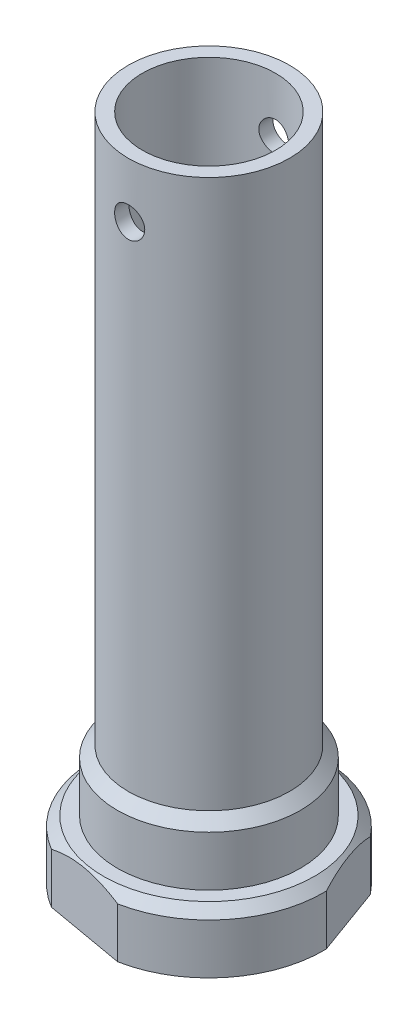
ISO-10303-21;
HEADER;
FILE_DESCRIPTION(('STEP AP214'),'2;1');
FILE_NAME('part.step','',(''),(''),'','','');
FILE_SCHEMA(('AUTOMOTIVE_DESIGN { 1 0 10303 214 1 1 1 1 }'));
ENDSEC;
DATA;
#1=APPLICATION_CONTEXT('core data for automotive mechanical design processes');
#2=APPLICATION_PROTOCOL_DEFINITION('international standard','automotive_design',2000,#1);
#3=PRODUCT_CONTEXT('',#1,'mechanical');
#4=PRODUCT('Part','Part','',(#3));
#5=PRODUCT_RELATED_PRODUCT_CATEGORY('part','',(#4));
#6=PRODUCT_DEFINITION_FORMATION('','',#4);
#7=PRODUCT_DEFINITION_CONTEXT('part definition',#1,'design');
#8=PRODUCT_DEFINITION('design','',#6,#7);
#9=PRODUCT_DEFINITION_SHAPE('','',#8);
#10=(LENGTH_UNIT() NAMED_UNIT(*) SI_UNIT(.MILLI.,.METRE.));
#11=(NAMED_UNIT(*) PLANE_ANGLE_UNIT() SI_UNIT($,.RADIAN.));
#12=(NAMED_UNIT(*) SI_UNIT($,.STERADIAN.) SOLID_ANGLE_UNIT());
#13=UNCERTAINTY_MEASURE_WITH_UNIT(LENGTH_MEASURE(1.E-05),#10,'distance_accuracy_value','');
#14=(GEOMETRIC_REPRESENTATION_CONTEXT(3) GLOBAL_UNCERTAINTY_ASSIGNED_CONTEXT((#13)) GLOBAL_UNIT_ASSIGNED_CONTEXT((#10,
#11,#12)) REPRESENTATION_CONTEXT('',''));
#15=CARTESIAN_POINT('',(0.,0.,0.));
#16=DIRECTION('',(0.,0.,1.));
#17=DIRECTION('',(1.,0.,0.));
#18=AXIS2_PLACEMENT_3D('',#15,#16,#17);
#19=CARTESIAN_POINT('',(0.,0.,0.));
#20=DIRECTION('',(0.,-1.,0.));
#21=DIRECTION('',(0.,0.,-1.));
#22=AXIS2_PLACEMENT_3D('',#19,#20,#21);
#23=CYLINDRICAL_SURFACE('',#22,12.446);
#24=DIRECTION('',(0.,-1.,0.));
#25=VECTOR('',#24,1.);
#26=CARTESIAN_POINT('',(-6.45693817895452,0.,-10.6400594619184));
#27=LINE('',#26,#25);
#28=CARTESIAN_POINT('',(-6.45693817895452,5.43560000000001,-10.6400594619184));
#29=VERTEX_POINT('',#28);
#30=CARTESIAN_POINT('',(-6.45693817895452,0.,-10.6400594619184));
#31=VERTEX_POINT('',#30);
#32=EDGE_CURVE('E198',#29,#31,#27,.T.);
#33=ORIENTED_EDGE('',*,*,#32,.F.);
#34=CARTESIAN_POINT('',(0.,5.43560000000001,0.));
#35=DIRECTION('',(0.,-1.,0.));
#36=DIRECTION('',(0.,0.,-1.));
#37=AXIS2_PLACEMENT_3D('',#34,#35,#36);
#38=CIRCLE('',#37,12.446);
#39=CARTESIAN_POINT('',(9.70665182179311,5.43560000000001,-7.78998243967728));
#40=VERTEX_POINT('',#39);
#41=EDGE_CURVE('E55',#29,#40,#38,.T.);
#42=ORIENTED_EDGE('',*,*,#41,.T.);
#43=DIRECTION('',(0.,-1.,0.));
#44=VECTOR('',#43,1.);
#45=CARTESIAN_POINT('',(9.70665182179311,0.,-7.78998243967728));
#46=LINE('',#45,#44);
#47=CARTESIAN_POINT('',(9.70665182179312,0.,-7.78998243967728));
#48=VERTEX_POINT('',#47);
#49=EDGE_CURVE('E134',#48,#40,#46,.F.);
#50=ORIENTED_EDGE('',*,*,#49,.F.);
#51=CARTESIAN_POINT('',(0.,0.,0.));
#52=DIRECTION('',(0.,-1.,0.));
#53=DIRECTION('',(0.,0.,-1.));
#54=AXIS2_PLACEMENT_3D('',#51,#52,#53);
#55=CIRCLE('',#54,12.446);
#56=EDGE_CURVE('E118',#31,#48,#55,.T.);
#57=ORIENTED_EDGE('',*,*,#56,.F.);
#58=EDGE_LOOP('',(#33,#42,#50,#57));
#59=FACE_BOUND('',#58,.T.);
#60=ADVANCED_FACE('F36',(#59),#23,.T.);
#61=DIRECTION('',(0.,-1.,0.));
#62=VECTOR('',#61,1.);
#63=CARTESIAN_POINT('',(-6.37685096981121,0.,10.6882499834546));
#64=LINE('',#63,#62);
#65=CARTESIAN_POINT('',(-6.37685096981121,5.43560000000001,10.6882499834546));
#66=VERTEX_POINT('',#65);
#67=CARTESIAN_POINT('',(-6.37685096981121,0.,10.6882499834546));
#68=VERTEX_POINT('',#67);
#69=EDGE_CURVE('E91',#66,#68,#64,.T.);
#70=ORIENTED_EDGE('',*,*,#69,.F.);
#71=CARTESIAN_POINT('',(0.,5.43560000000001,0.));
#72=DIRECTION('',(0.,-1.,0.));
#73=DIRECTION('',(0.,0.,-1.));
#74=AXIS2_PLACEMENT_3D('',#71,#72,#73);
#75=CIRCLE('',#74,12.446);
#76=CARTESIAN_POINT('',(-11.5996485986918,5.43560000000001,-4.51121584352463));
#77=VERTEX_POINT('',#76);
#78=EDGE_CURVE('E207',#66,#77,#75,.T.);
#79=ORIENTED_EDGE('',*,*,#78,.T.);
#80=DIRECTION('',(0.,-1.,0.));
#81=VECTOR('',#80,1.);
#82=CARTESIAN_POINT('',(-11.5996485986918,0.,-4.51121584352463));
#83=LINE('',#82,#81);
#84=CARTESIAN_POINT('',(-11.5996485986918,0.,-4.51121584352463));
#85=VERTEX_POINT('',#84);
#86=EDGE_CURVE('E117',#85,#77,#83,.F.);
#87=ORIENTED_EDGE('',*,*,#86,.F.);
#88=EDGE_CURVE('E109',#68,#85,#55,.T.);
#89=ORIENTED_EDGE('',*,*,#88,.F.);
#90=EDGE_LOOP('',(#70,#79,#87,#89));
#91=FACE_BOUND('',#90,.T.);
#92=ADVANCED_FACE('F115',(#91),#23,.T.);
#93=CARTESIAN_POINT('',(0.,0.,0.));
#94=DIRECTION('',(0.,-1.,0.));
#95=DIRECTION('',(0.,0.,-1.));
#96=AXIS2_PLACEMENT_3D('',#93,#94,#95);
#97=PLANE('',#96);
#98=DIRECTION('',(-0.34202014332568,0.,-0.939692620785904));
#99=VECTOR('',#98,1.);
#100=CARTESIAN_POINT('',(4.09309592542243,0.,-23.2131005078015));
#101=LINE('',#100,#99);
#102=CARTESIAN_POINT('',(12.4430308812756,0.,-0.271842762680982));
#103=VERTEX_POINT('',#102);
#104=EDGE_CURVE('E232',#103,#48,#101,.T.);
#105=ORIENTED_EDGE('',*,*,#104,.F.);
#106=CARTESIAN_POINT('',(2.33668300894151,0.,12.2246811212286));
#107=VERTEX_POINT('',#106);
#108=EDGE_CURVE('E111',#103,#107,#55,.T.);
#109=ORIENTED_EDGE('',*,*,#108,.T.);
#110=DIRECTION('',(0.984807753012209,0.,0.173648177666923));
#111=VECTOR('',#110,1.);
#112=CARTESIAN_POINT('',(-22.0365672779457,0.,7.92701948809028));
#113=LINE('',#112,#111);
#114=EDGE_CURVE('E95',#68,#107,#113,.T.);
#115=ORIENTED_EDGE('',*,*,#114,.F.);
#116=ORIENTED_EDGE('',*,*,#88,.T.);
#117=DIRECTION('',(-0.642787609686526,0.,0.766044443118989));
#118=VECTOR('',#117,1.);
#119=CARTESIAN_POINT('',(4.09309592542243,0.,-23.2131005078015));
#120=LINE('',#119,#118);
#121=EDGE_CURVE('E112',#31,#85,#120,.T.);
#122=ORIENTED_EDGE('',*,*,#121,.F.);
#123=ORIENTED_EDGE('',*,*,#56,.T.);
#124=EDGE_LOOP('',(#105,#109,#115,#116,#122,#123));
#125=FACE_BOUND('',#124,.T.);
#126=ADVANCED_FACE('F107',(#125),#97,.T.);
#127=DIRECTION('',(0.,-1.,0.));
#128=VECTOR('',#127,1.);
#129=CARTESIAN_POINT('',(12.4430308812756,0.,-0.271842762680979));
#130=LINE('',#129,#128);
#131=CARTESIAN_POINT('',(12.4430308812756,5.43560000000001,-0.271842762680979));
#132=VERTEX_POINT('',#131);
#133=EDGE_CURVE('E228',#132,#103,#130,.T.);
#134=ORIENTED_EDGE('',*,*,#133,.F.);
#135=CARTESIAN_POINT('',(0.,5.43560000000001,0.));
#136=DIRECTION('',(0.,1.,0.));
#137=DIRECTION('',(0.,0.,1.));
#138=AXIS2_PLACEMENT_3D('',#135,#136,#137);
#139=CIRCLE('',#138,12.446);
#140=CARTESIAN_POINT('',(2.33668300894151,5.43560000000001,12.2246811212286));
#141=VERTEX_POINT('',#140);
#142=EDGE_CURVE('E120',#132,#141,#139,.F.);
#143=ORIENTED_EDGE('',*,*,#142,.T.);
#144=DIRECTION('',(0.,-1.,0.));
#145=VECTOR('',#144,1.);
#146=CARTESIAN_POINT('',(2.33668300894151,0.,12.2246811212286));
#147=LINE('',#146,#145);
#148=EDGE_CURVE('E101',#107,#141,#147,.F.);
#149=ORIENTED_EDGE('',*,*,#148,.F.);
#150=ORIENTED_EDGE('',*,*,#108,.F.);
#151=EDGE_LOOP('',(#134,#143,#149,#150));
#152=FACE_BOUND('',#151,.T.);
#153=ADVANCED_FACE('F186',(#152),#23,.T.);
#154=CARTESIAN_POINT('',(12.446,6.4516,0.));
#155=DIRECTION('',(0.,1.,0.));
#156=DIRECTION('',(0.,0.,1.));
#157=AXIS2_PLACEMENT_3D('',#154,#155,#156);
#158=PLANE('',#157);
#159=CARTESIAN_POINT('',(0.,6.4516,0.));
#160=DIRECTION('',(0.,1.,0.));
#161=DIRECTION('',(0.,0.,1.));
#162=AXIS2_PLACEMENT_3D('',#159,#160,#161);
#163=CIRCLE('',#162,11.43);
#164=CARTESIAN_POINT('',(11.4272732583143,6.4516,-0.249651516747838));
#165=VERTEX_POINT('',#164);
#166=EDGE_CURVE('E12',#165,#165,#163,.T.);
#167=ORIENTED_EDGE('',*,*,#166,.T.);
#168=EDGE_LOOP('',(#167));
#169=FACE_BOUND('',#168,.T.);
#170=CARTESIAN_POINT('',(0.,6.4516,0.));
#171=DIRECTION('',(0.,-1.,0.));
#172=DIRECTION('',(0.,0.,-1.));
#173=AXIS2_PLACEMENT_3D('',#170,#171,#172);
#174=CIRCLE('',#173,9.9187);
#175=CARTESIAN_POINT('',(0.,6.4516,-9.9187));
#176=VERTEX_POINT('',#175);
#177=EDGE_CURVE('E122',#176,#176,#174,.T.);
#178=ORIENTED_EDGE('',*,*,#177,.T.);
#179=EDGE_LOOP('',(#178));
#180=FACE_BOUND('',#179,.T.);
#181=ADVANCED_FACE('F182',(#169,#180),#158,.T.);
#182=CARTESIAN_POINT('',(0.,0.,0.));
#183=DIRECTION('',(0.,-1.,0.));
#184=DIRECTION('',(0.,0.,-1.));
#185=AXIS2_PLACEMENT_3D('',#182,#183,#184);
#186=CYLINDRICAL_SURFACE('',#185,9.9187);
#187=CARTESIAN_POINT('',(0.,11.8872,0.));
#188=DIRECTION('',(0.,-1.,0.));
#189=DIRECTION('',(0.,0.,-1.));
#190=AXIS2_PLACEMENT_3D('',#187,#188,#189);
#191=CIRCLE('',#190,9.9187);
#192=CARTESIAN_POINT('',(0.,11.8872,-9.9187));
#193=VERTEX_POINT('',#192);
#194=EDGE_CURVE('E354',#193,#193,#191,.T.);
#195=ORIENTED_EDGE('',*,*,#194,.T.);
#196=EDGE_LOOP('',(#195));
#197=FACE_BOUND('',#196,.T.);
#198=ORIENTED_EDGE('',*,*,#177,.F.);
#199=EDGE_LOOP('',(#198));
#200=FACE_BOUND('',#199,.T.);
#201=ADVANCED_FACE('F178',(#197,#200),#186,.T.);
#202=CARTESIAN_POINT('',(0.,11.8872,0.));
#203=DIRECTION('',(0.,-1.,0.));
#204=DIRECTION('',(0.,0.,-1.));
#205=AXIS2_PLACEMENT_3D('',#202,#203,#204);
#206=CONICAL_SURFACE('',#205,9.9187,0.78539816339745);
#207=CARTESIAN_POINT('',(0.,13.0683,0.));
#208=DIRECTION('',(0.,-1.,0.));
#209=DIRECTION('',(0.,0.,-1.));
#210=AXIS2_PLACEMENT_3D('',#207,#208,#209);
#211=CIRCLE('',#210,8.7376);
#212=CARTESIAN_POINT('',(0.,13.0683,-8.7376));
#213=VERTEX_POINT('',#212);
#214=EDGE_CURVE('E351',#213,#213,#211,.T.);
#215=ORIENTED_EDGE('',*,*,#214,.T.);
#216=EDGE_LOOP('',(#215));
#217=FACE_BOUND('',#216,.T.);
#218=ORIENTED_EDGE('',*,*,#194,.F.);
#219=EDGE_LOOP('',(#218));
#220=FACE_BOUND('',#219,.T.);
#221=ADVANCED_FACE('F173',(#217,#220),#206,.T.);
#222=CARTESIAN_POINT('',(0.,0.,0.));
#223=DIRECTION('',(0.,-1.,0.));
#224=DIRECTION('',(0.,0.,-1.));
#225=AXIS2_PLACEMENT_3D('',#222,#223,#224);
#226=CYLINDRICAL_SURFACE('',#225,8.7376);
#227=CARTESIAN_POINT('',(0.,68.1482,-8.7376));
#228=CARTESIAN_POINT('',(0.0908209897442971,68.1481965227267,-8.73759835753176));
#229=CARTESIAN_POINT('',(0.181687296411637,68.140592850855,-8.7361693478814));
#230=CARTESIAN_POINT('',(0.36085979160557,68.1103983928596,-8.73060647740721));
#231=CARTESIAN_POINT('',(0.449163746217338,68.0877949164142,-8.72647032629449));
#232=CARTESIAN_POINT('',(0.620594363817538,68.0283167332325,-8.7159558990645));
#233=CARTESIAN_POINT('',(0.703725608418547,67.9914548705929,-8.70957964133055));
#234=CARTESIAN_POINT('',(0.862615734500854,67.9045426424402,-8.69528145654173));
#235=CARTESIAN_POINT('',(0.938375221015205,67.8544933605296,-8.68735965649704));
#236=CARTESIAN_POINT('',(1.08127962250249,67.7419954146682,-8.67073960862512));
#237=CARTESIAN_POINT('',(1.14832423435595,67.6794204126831,-8.66203399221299));
#238=CARTESIAN_POINT('',(1.27102806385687,67.5439190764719,-8.64488224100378));
#239=CARTESIAN_POINT('',(1.32668646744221,67.4709920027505,-8.63643612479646));
#240=CARTESIAN_POINT('',(1.4254545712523,67.3161485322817,-8.62068805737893));
#241=CARTESIAN_POINT('',(1.46846234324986,67.2341660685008,-8.61339560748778));
#242=CARTESIAN_POINT('',(1.54005587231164,67.0639805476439,-8.60088431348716));
#243=CARTESIAN_POINT('',(1.56864286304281,66.9757780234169,-8.59566529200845));
#244=CARTESIAN_POINT('',(1.6102616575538,66.796728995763,-8.58796590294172));
#245=CARTESIAN_POINT('',(1.62346832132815,66.7059244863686,-8.58545477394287));
#246=CARTESIAN_POINT('',(1.63449430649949,66.5233564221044,-8.58336273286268));
#247=CARTESIAN_POINT('',(1.63231499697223,66.4315929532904,-8.58378156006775));
#248=CARTESIAN_POINT('',(1.61277271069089,66.2509779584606,-8.587474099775));
#249=CARTESIAN_POINT('',(1.59560848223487,66.1621040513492,-8.59071044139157));
#250=CARTESIAN_POINT('',(1.5468965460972,65.9885199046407,-8.59961466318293));
#251=CARTESIAN_POINT('',(1.51534823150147,65.9038098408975,-8.60528264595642));
#252=CARTESIAN_POINT('',(1.43856903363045,65.7403759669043,-8.61845062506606));
#253=CARTESIAN_POINT('',(1.39325781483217,65.6616907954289,-8.62596132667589));
#254=CARTESIAN_POINT('',(1.2902958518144,65.5129655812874,-8.64196138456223));
#255=CARTESIAN_POINT('',(1.23264386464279,65.4429264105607,-8.6504508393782));
#256=CARTESIAN_POINT('',(1.10556491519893,65.3123329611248,-8.66761474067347));
#257=CARTESIAN_POINT('',(1.03596793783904,65.251944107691,-8.67629000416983));
#258=CARTESIAN_POINT('',(0.88754373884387,65.1436740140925,-8.69272602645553));
#259=CARTESIAN_POINT('',(0.808716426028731,65.0957928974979,-8.70048677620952));
#260=CARTESIAN_POINT('',(0.643897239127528,65.013873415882,-8.71423482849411));
#261=CARTESIAN_POINT('',(0.557896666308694,64.9798521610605,-8.72021993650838));
#262=CARTESIAN_POINT('',(0.381264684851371,64.9267848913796,-8.7297253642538));
#263=CARTESIAN_POINT('',(0.290633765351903,64.9077372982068,-8.73324594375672));
#264=CARTESIAN_POINT('',(0.108737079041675,64.8853880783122,-8.73738998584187));
#265=CARTESIAN_POINT('',(0.0175000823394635,64.8818597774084,-8.73805515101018));
#266=CARTESIAN_POINT('',(-0.164260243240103,64.8900414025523,-8.73652857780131));
#267=CARTESIAN_POINT('',(-0.254783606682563,64.9017505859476,-8.73433697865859));
#268=CARTESIAN_POINT('',(-0.431828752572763,64.9398863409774,-8.72736909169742));
#269=CARTESIAN_POINT('',(-0.518376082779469,64.9661983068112,-8.72261293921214));
#270=CARTESIAN_POINT('',(-0.685830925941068,65.0326687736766,-8.71104704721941));
#271=CARTESIAN_POINT('',(-0.766738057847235,65.0728282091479,-8.70423716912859));
#272=CARTESIAN_POINT('',(-0.921583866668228,65.1663559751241,-8.68921519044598));
#273=CARTESIAN_POINT('',(-0.99543738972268,65.2198629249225,-8.68098867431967));
#274=CARTESIAN_POINT('',(-1.13319855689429,65.3383791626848,-8.66408336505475));
#275=CARTESIAN_POINT('',(-1.19710527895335,65.40338951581,-8.65540453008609));
#276=CARTESIAN_POINT('',(-1.31401931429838,65.5440930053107,-8.63843452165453));
#277=CARTESIAN_POINT('',(-1.36687199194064,65.6199155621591,-8.63014995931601));
#278=CARTESIAN_POINT('',(-1.45909069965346,65.7794959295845,-8.61503922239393));
#279=CARTESIAN_POINT('',(-1.49845722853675,65.8632534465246,-8.60821299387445));
#280=CARTESIAN_POINT('',(-1.56236649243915,66.0359321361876,-8.59684362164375));
#281=CARTESIAN_POINT('',(-1.58698032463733,66.1248262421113,-8.59228954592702));
#282=CARTESIAN_POINT('',(-1.62090492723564,66.3055812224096,-8.58595504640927));
#283=CARTESIAN_POINT('',(-1.63021740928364,66.3974417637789,-8.58417431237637));
#284=CARTESIAN_POINT('',(-1.6332180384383,66.5799732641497,-8.58360376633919));
#285=CARTESIAN_POINT('',(-1.62715008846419,66.6706401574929,-8.58476726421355));
#286=CARTESIAN_POINT('',(-1.60009584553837,66.8496373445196,-8.58985059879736));
#287=CARTESIAN_POINT('',(-1.57910964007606,66.9379676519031,-8.59377041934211));
#288=CARTESIAN_POINT('',(-1.52291717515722,67.1096544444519,-8.60390514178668));
#289=CARTESIAN_POINT('',(-1.4877371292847,67.1930197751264,-8.61011581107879));
#290=CARTESIAN_POINT('',(-1.40418223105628,67.3527038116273,-8.62413547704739));
#291=CARTESIAN_POINT('',(-1.35580645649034,67.4290220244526,-8.6319445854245));
#292=CARTESIAN_POINT('',(-1.24638453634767,67.5736675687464,-8.64842628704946));
#293=CARTESIAN_POINT('',(-1.18516081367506,67.6418593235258,-8.65710998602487));
#294=CARTESIAN_POINT('',(-1.05215135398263,67.7670828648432,-8.6742791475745));
#295=CARTESIAN_POINT('',(-0.980363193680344,67.8241120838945,-8.6827645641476));
#296=CARTESIAN_POINT('',(-0.827495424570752,67.9258667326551,-8.69866985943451));
#297=CARTESIAN_POINT('',(-0.746338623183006,67.9704778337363,-8.70607955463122));
#298=CARTESIAN_POINT('',(-0.577569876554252,68.0453608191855,-8.7188991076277));
#299=CARTESIAN_POINT('',(-0.489964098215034,68.0756462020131,-8.72431084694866));
#300=CARTESIAN_POINT('',(-0.335081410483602,68.1148532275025,-8.73141855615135));
#301=CARTESIAN_POINT('',(-0.26871118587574,68.1273369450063,-8.7337235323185));
#302=CARTESIAN_POINT('',(-0.134902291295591,68.1440115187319,-8.73681484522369));
#303=CARTESIAN_POINT('',(-0.067463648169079,68.1482025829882,-8.73760122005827));
#304=CARTESIAN_POINT('',(0.,68.1482,-8.7376));
#305=B_SPLINE_CURVE_WITH_KNOTS('',3,(#227,#228,#229,#230,#231,#232,#233,#234,#235,#236,#237,
#238,#239,#240,#241,#242,#243,#244,#245,#246,#247,#248,#249,#250,#251,#252,#253,#254,#255,#256,
#257,#258,#259,#260,#261,#262,#263,#264,#265,#266,#267,#268,#269,#270,#271,#272,#273,#274,#275,
#276,#277,#278,#279,#280,#281,#282,#283,#284,#285,#286,#287,#288,#289,#290,#291,#292,#293,#294,
#295,#296,#297,#298,#299,#300,#301,#302,#303,#304),.UNSPECIFIED.,.T.,.F.,(4,2,2,2,2,2,2,2,2,2,2,
2,2,2,2,2,2,2,2,2,2,2,2,2,2,2,2,2,2,2,2,2,2,2,2,2,2,2,4),(0.,0.272216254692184,
0.544663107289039,0.816865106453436,1.08904474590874,1.36412216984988,1.63921925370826,
1.91647566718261,2.1937083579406,2.46775741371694,2.74178208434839,3.01222659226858,
3.28268251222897,3.55474848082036,3.82684186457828,4.1031896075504,4.37954008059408,
4.65623068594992,4.93289212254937,5.20549894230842,5.47809247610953,5.74857628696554,
6.0190783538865,6.29251603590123,6.56597905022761,6.84304370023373,7.1200981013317,
7.39580633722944,7.67148372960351,7.942816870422,8.21414841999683,8.48498114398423,
8.75583280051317,9.03070877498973,9.30564789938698,9.58304033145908,9.86017086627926,
10.062383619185,10.2645912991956),.UNSPECIFIED.);
#306=CARTESIAN_POINT('',(0.,68.1482,-8.7376));
#307=VERTEX_POINT('',#306);
#308=EDGE_CURVE('E163',#307,#307,#305,.T.);
#309=ORIENTED_EDGE('',*,*,#308,.F.);
#310=EDGE_LOOP('',(#309));
#311=FACE_BOUND('',#310,.T.);
#312=CARTESIAN_POINT('',(1.63195,66.51625,8.58384488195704));
#313=CARTESIAN_POINT('',(1.63194651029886,66.6070554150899,8.58384663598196));
#314=CARTESIAN_POINT('',(1.62434535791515,66.6979061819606,8.58530142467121));
#315=CARTESIAN_POINT('',(1.59416181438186,66.877046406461,8.59095621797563));
#316=CARTESIAN_POINT('',(1.57156667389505,66.9653336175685,8.59515855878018));
#317=CARTESIAN_POINT('',(1.51211286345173,67.1367287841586,8.60581628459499));
#318=CARTESIAN_POINT('',(1.47526742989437,67.219841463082,8.61226957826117));
#319=CARTESIAN_POINT('',(1.38839392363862,67.3787003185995,8.62669961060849));
#320=CARTESIAN_POINT('',(1.33836689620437,67.454447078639,8.63467622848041));
#321=CARTESIAN_POINT('',(1.22589171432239,67.5973651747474,8.65136418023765));
#322=CARTESIAN_POINT('',(1.16331222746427,67.6644323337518,8.66008266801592));
#323=CARTESIAN_POINT('',(1.02779236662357,67.7871798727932,8.67720880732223));
#324=CARTESIAN_POINT('',(0.954851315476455,67.8428595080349,8.68561643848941));
#325=CARTESIAN_POINT('',(0.799994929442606,67.9416503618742,8.70125015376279));
#326=CARTESIAN_POINT('',(0.71801593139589,67.9846634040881,8.70846682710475));
#327=CARTESIAN_POINT('',(0.547837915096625,68.0562676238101,8.72082544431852));
#328=CARTESIAN_POINT('',(0.459639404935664,68.0848599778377,8.72596755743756));
#329=CARTESIAN_POINT('',(0.280605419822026,68.1264891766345,8.73354714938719));
#330=CARTESIAN_POINT('',(0.189812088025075,68.1397016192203,8.73601513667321));
#331=CARTESIAN_POINT('',(0.00726611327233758,68.1507430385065,8.73807354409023));
#332=CARTESIAN_POINT('',(-0.0844864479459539,68.148573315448,8.73766420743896));
#333=CARTESIAN_POINT('',(-0.265142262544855,68.1290467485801,8.73403794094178));
#334=CARTESIAN_POINT('',(-0.354066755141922,68.111878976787,8.7308559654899));
#335=CARTESIAN_POINT('',(-0.527750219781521,68.0631426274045,8.7220811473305));
#336=CARTESIAN_POINT('',(-0.612509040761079,68.0315735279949,8.71648821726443));
#337=CARTESIAN_POINT('',(-0.776004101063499,67.9547502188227,8.70346145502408));
#338=CARTESIAN_POINT('',(-0.854703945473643,67.9094203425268,8.69601748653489));
#339=CARTESIAN_POINT('',(-1.0034507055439,67.8064179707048,8.6801120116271));
#340=CARTESIAN_POINT('',(-1.07349674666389,67.7487442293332,8.67165040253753));
#341=CARTESIAN_POINT('',(-1.20406767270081,67.6216491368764,8.65449506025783));
#342=CARTESIAN_POINT('',(-1.26443145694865,67.552062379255,8.64579975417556));
#343=CARTESIAN_POINT('',(-1.37265574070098,67.4036677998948,8.62928016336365));
#344=CARTESIAN_POINT('',(-1.42051606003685,67.3248598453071,8.62145589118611));
#345=CARTESIAN_POINT('',(-1.5024202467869,67.1600473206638,8.60756202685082));
#346=CARTESIAN_POINT('',(-1.53644084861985,67.0740309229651,8.60149539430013));
#347=CARTESIAN_POINT('',(-1.58950203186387,66.8973643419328,8.59184913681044));
#348=CARTESIAN_POINT('',(-1.60854429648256,66.806714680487,8.58826923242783));
#349=CARTESIAN_POINT('',(-1.63087335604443,66.6248070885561,8.58405700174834));
#350=CARTESIAN_POINT('',(-1.63439153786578,66.5335785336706,8.58338139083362));
#351=CARTESIAN_POINT('',(-1.62619268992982,66.3518374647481,8.58493843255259));
#352=CARTESIAN_POINT('',(-1.61447640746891,66.2613249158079,8.58717094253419));
#353=CARTESIAN_POINT('',(-1.57633980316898,66.084344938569,8.59425237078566));
#354=CARTESIAN_POINT('',(-1.55004065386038,65.9978504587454,8.59907971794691));
#355=CARTESIAN_POINT('',(-1.4836133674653,65.8304956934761,8.61078833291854));
#356=CARTESIAN_POINT('',(-1.44348421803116,65.7496358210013,8.61766975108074));
#357=CARTESIAN_POINT('',(-1.35000299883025,65.5948258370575,8.63280978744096));
#358=CARTESIAN_POINT('',(-1.29650468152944,65.5209655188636,8.64108328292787));
#359=CARTESIAN_POINT('',(-1.17800108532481,65.3831866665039,8.65803334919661));
#360=CARTESIAN_POINT('',(-1.1129947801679,65.3192690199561,8.66670995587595));
#361=CARTESIAN_POINT('',(-0.972287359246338,65.2023261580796,8.68362762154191));
#362=CARTESIAN_POINT('',(-0.896455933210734,65.1494565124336,8.69186138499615));
#363=CARTESIAN_POINT('',(-0.736852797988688,65.0572080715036,8.70684309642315));
#364=CARTESIAN_POINT('',(-0.653081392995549,65.0178287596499,8.71359110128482));
#365=CARTESIAN_POINT('',(-0.480407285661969,64.9539120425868,8.72480959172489));
#366=CARTESIAN_POINT('',(-0.391533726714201,64.9292980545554,8.72929180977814));
#367=CARTESIAN_POINT('',(-0.210822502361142,64.8953661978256,8.73552373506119));
#368=CARTESIAN_POINT('',(-0.118985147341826,64.8860467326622,8.73727372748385));
#369=CARTESIAN_POINT('',(0.0635544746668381,64.8830236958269,8.73783841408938));
#370=CARTESIAN_POINT('',(0.154252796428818,64.8890850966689,8.73669728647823));
#371=CARTESIAN_POINT('',(0.333314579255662,64.9161372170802,8.73169969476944));
#372=CARTESIAN_POINT('',(0.421678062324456,64.9371277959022,8.72784325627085));
#373=CARTESIAN_POINT('',(0.593438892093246,64.9933437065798,8.71784826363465));
#374=CARTESIAN_POINT('',(0.676844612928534,65.0285442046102,8.71171369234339));
#375=CARTESIAN_POINT('',(0.836601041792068,65.1121526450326,8.69782671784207));
#376=CARTESIAN_POINT('',(0.912951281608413,65.1605614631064,8.69007420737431));
#377=CARTESIAN_POINT('',(1.05760108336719,65.2700222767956,8.67366789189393));
#378=CARTESIAN_POINT('',(1.12577082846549,65.3312441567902,8.66500284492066));
#379=CARTESIAN_POINT('',(1.2509508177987,65.4642405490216,8.64781926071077));
#380=CARTESIAN_POINT('',(1.30795843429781,65.5360175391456,8.63930075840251));
#381=CARTESIAN_POINT('',(1.40968669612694,65.6888738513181,8.62328943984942));
#382=CARTESIAN_POINT('',(1.4542898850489,65.770032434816,8.61580674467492));
#383=CARTESIAN_POINT('',(1.52915760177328,65.9388043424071,8.60283594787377));
#384=CARTESIAN_POINT('',(1.5594356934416,66.0264114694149,8.59734596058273));
#385=CARTESIAN_POINT('',(1.59862460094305,66.1812752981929,8.59012959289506));
#386=CARTESIAN_POINT('',(1.61110025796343,66.2476241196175,8.58778678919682));
#387=CARTESIAN_POINT('',(1.62776414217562,66.3813903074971,8.58464380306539));
#388=CARTESIAN_POINT('',(1.63195259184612,66.4488076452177,8.58384357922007));
#389=CARTESIAN_POINT('',(1.63195,66.51625,8.58384488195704));
#390=B_SPLINE_CURVE_WITH_KNOTS('',3,(#312,#313,#314,#315,#316,#317,#318,#319,#320,#321,#322,
#323,#324,#325,#326,#327,#328,#329,#330,#331,#332,#333,#334,#335,#336,#337,#338,#339,#340,#341,
#342,#343,#344,#345,#346,#347,#348,#349,#350,#351,#352,#353,#354,#355,#356,#357,#358,#359,#360,
#361,#362,#363,#364,#365,#366,#367,#368,#369,#370,#371,#372,#373,#374,#375,#376,#377,#378,#379,
#380,#381,#382,#383,#384,#385,#386,#387,#388,#389),.UNSPECIFIED.,.T.,.F.,(4,2,2,2,2,2,2,2,2,2,2,
2,2,2,2,2,2,2,2,2,2,2,2,2,2,2,2,2,2,2,2,2,2,2,2,2,2,2,4),(0.,0.272169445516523,
0.544570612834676,0.81671936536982,1.08884654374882,1.36398523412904,1.63914191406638,
1.91637830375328,2.19359207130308,2.46760874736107,2.74160226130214,3.012190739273,
3.28278902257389,3.55490306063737,3.82704457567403,4.10332721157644,4.37961382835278,
4.65636300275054,4.93308107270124,5.2056604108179,5.47822637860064,5.74856075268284,
6.01891491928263,6.29236697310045,6.56584342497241,6.84294394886,7.12003386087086,
7.39567388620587,7.6712851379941,7.94271035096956,8.21413300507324,8.48508334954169,
8.75605166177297,9.03087042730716,9.30575381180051,9.58315769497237,9.86029838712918,
10.06244757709,10.2645913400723),.UNSPECIFIED.);
#391=CARTESIAN_POINT('',(1.63195,66.51625,8.58384488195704));
#392=VERTEX_POINT('',#391);
#393=EDGE_CURVE('E157',#392,#392,#390,.T.);
#394=ORIENTED_EDGE('',*,*,#393,.F.);
#395=EDGE_LOOP('',(#394));
#396=FACE_BOUND('',#395,.T.);
#397=CARTESIAN_POINT('',(0.,72.4916,0.));
#398=DIRECTION('',(0.,-1.,0.));
#399=DIRECTION('',(0.,0.,-1.));
#400=AXIS2_PLACEMENT_3D('',#397,#398,#399);
#401=CIRCLE('',#400,8.7376);
#402=CARTESIAN_POINT('',(0.,72.4916,-8.7376));
#403=VERTEX_POINT('',#402);
#404=EDGE_CURVE('E349',#403,#403,#401,.T.);
#405=ORIENTED_EDGE('',*,*,#404,.T.);
#406=EDGE_LOOP('',(#405));
#407=FACE_BOUND('',#406,.T.);
#408=ORIENTED_EDGE('',*,*,#214,.F.);
#409=EDGE_LOOP('',(#408));
#410=FACE_BOUND('',#409,.T.);
#411=ADVANCED_FACE('F168',(#311,#396,#407,#410),#226,.T.);
#412=CARTESIAN_POINT('',(8.7376,72.4916,0.));
#413=DIRECTION('',(0.,1.,0.));
#414=DIRECTION('',(0.,0.,1.));
#415=AXIS2_PLACEMENT_3D('',#412,#413,#414);
#416=PLANE('',#415);
#417=CARTESIAN_POINT('',(0.,72.4916,0.));
#418=DIRECTION('',(0.,-1.,0.));
#419=DIRECTION('',(0.,0.,-1.));
#420=AXIS2_PLACEMENT_3D('',#417,#418,#419);
#421=CIRCLE('',#420,7.2263);
#422=CARTESIAN_POINT('',(0.,72.4916,-7.2263));
#423=VERTEX_POINT('',#422);
#424=EDGE_CURVE('E346',#423,#423,#421,.T.);
#425=ORIENTED_EDGE('',*,*,#424,.T.);
#426=EDGE_LOOP('',(#425));
#427=FACE_BOUND('',#426,.T.);
#428=ORIENTED_EDGE('',*,*,#404,.F.);
#429=EDGE_LOOP('',(#428));
#430=FACE_BOUND('',#429,.T.);
#431=ADVANCED_FACE('F172',(#427,#430),#416,.T.);
#432=CARTESIAN_POINT('',(0.,0.,0.));
#433=DIRECTION('',(0.,-1.,0.));
#434=DIRECTION('',(0.,0.,-1.));
#435=AXIS2_PLACEMENT_3D('',#432,#433,#434);
#436=CYLINDRICAL_SURFACE('',#435,7.2263);
#437=CARTESIAN_POINT('',(0.,68.1482,-7.2263));
#438=CARTESIAN_POINT('',(-0.0904373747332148,68.1481970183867,-7.22629834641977));
#439=CARTESIAN_POINT('',(-0.180910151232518,68.1406570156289,-7.22458507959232));
#440=CARTESIAN_POINT('',(-0.359280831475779,68.110730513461,-7.21791610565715));
#441=CARTESIAN_POINT('',(-0.447176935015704,68.0883338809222,-7.21295818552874));
#442=CARTESIAN_POINT('',(-0.617791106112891,68.0294353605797,-7.20035128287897));
#443=CARTESIAN_POINT('',(-0.700514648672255,67.9929486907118,-7.19270520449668));
#444=CARTESIAN_POINT('',(-0.85866386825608,67.9069552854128,-7.17554483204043));
#445=CARTESIAN_POINT('',(-0.934089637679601,67.8574487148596,-7.16603056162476));
#446=CARTESIAN_POINT('',(-1.07678967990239,67.7459284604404,-7.14599279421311));
#447=CARTESIAN_POINT('',(-1.14392181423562,67.6837352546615,-7.1354560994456));
#448=CARTESIAN_POINT('',(-1.26689583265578,67.5489923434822,-7.1146528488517));
#449=CARTESIAN_POINT('',(-1.3227366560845,67.4764416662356,-7.10438631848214));
#450=CARTESIAN_POINT('',(-1.42217896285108,67.321980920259,-7.08515509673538));
#451=CARTESIAN_POINT('',(-1.46562746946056,67.2399700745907,-7.07620728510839));
#452=CARTESIAN_POINT('',(-1.53807000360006,67.0695752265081,-7.06081673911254));
#453=CARTESIAN_POINT('',(-1.56706588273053,66.9811920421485,-7.05437368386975));
#454=CARTESIAN_POINT('',(-1.60930702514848,66.8021080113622,-7.04485685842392));
#455=CARTESIAN_POINT('',(-1.62280482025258,66.7114696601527,-7.0417291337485));
#456=CARTESIAN_POINT('',(-1.63445217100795,66.5291651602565,-7.03903518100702));
#457=CARTESIAN_POINT('',(-1.6326037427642,66.4374991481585,-7.03946848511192));
#458=CARTESIAN_POINT('',(-1.61381396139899,66.2576310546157,-7.04379885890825));
#459=CARTESIAN_POINT('',(-1.59716756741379,66.1693962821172,-7.0476282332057));
#460=CARTESIAN_POINT('',(-1.54972238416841,65.9970050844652,-7.05821206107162));
#461=CARTESIAN_POINT('',(-1.51892275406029,65.9128489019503,-7.06496668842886));
#462=CARTESIAN_POINT('',(-1.44377882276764,65.7501828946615,-7.0807056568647));
#463=CARTESIAN_POINT('',(-1.3993224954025,65.6717266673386,-7.08970831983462));
#464=CARTESIAN_POINT('',(-1.29820579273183,65.5232792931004,-7.10891794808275));
#465=CARTESIAN_POINT('',(-1.24154365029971,65.4532893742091,-7.11912508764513));
#466=CARTESIAN_POINT('',(-1.11606961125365,65.3220648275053,-7.13988287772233));
#467=CARTESIAN_POINT('',(-1.04700729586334,65.261069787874,-7.15043601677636));
#468=CARTESIAN_POINT('',(-0.89951271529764,65.151486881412,-7.17048248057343));
#469=CARTESIAN_POINT('',(-0.821080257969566,65.1028992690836,-7.17997578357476));
#470=CARTESIAN_POINT('',(-0.656768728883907,65.0194451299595,-7.19686702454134));
#471=CARTESIAN_POINT('',(-0.570872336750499,64.9846116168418,-7.20425990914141));
#472=CARTESIAN_POINT('',(-0.394240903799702,64.9299403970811,-7.21608000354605));
#473=CARTESIAN_POINT('',(-0.303506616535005,64.9101003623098,-7.22050767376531));
#474=CARTESIAN_POINT('',(-0.121828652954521,64.8863315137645,-7.22583236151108));
#475=CARTESIAN_POINT('',(-0.0309298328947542,64.8820756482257,-7.2268019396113));
#476=CARTESIAN_POINT('',(0.150280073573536,64.888707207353,-7.22530525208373));
#477=CARTESIAN_POINT('',(0.240591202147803,64.8995935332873,-7.22283923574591));
#478=CARTESIAN_POINT('',(0.416967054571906,64.9359295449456,-7.21479439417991));
#479=CARTESIAN_POINT('',(0.503069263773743,64.961206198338,-7.20925257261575));
#480=CARTESIAN_POINT('',(0.669810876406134,65.0254120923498,-7.1956771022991));
#481=CARTESIAN_POINT('',(0.750449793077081,65.0643425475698,-7.18764323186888));
#482=CARTESIAN_POINT('',(0.905317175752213,65.155421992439,-7.16979679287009));
#483=CARTESIAN_POINT('',(0.979430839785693,65.2077611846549,-7.15995926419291));
#484=CARTESIAN_POINT('',(1.11794043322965,65.3239235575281,-7.13964494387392));
#485=CARTESIAN_POINT('',(1.18233500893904,65.38774833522,-7.12916806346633));
#486=CARTESIAN_POINT('',(1.30088361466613,65.5265751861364,-7.10850287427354));
#487=CARTESIAN_POINT('',(1.35481047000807,65.6017729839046,-7.09832434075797));
#488=CARTESIAN_POINT('',(1.44927239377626,65.7603490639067,-7.07964328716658));
#489=CARTESIAN_POINT('',(1.4898080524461,65.8437269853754,-7.07114069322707));
#490=CARTESIAN_POINT('',(1.55605483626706,66.0158438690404,-7.05685866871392));
#491=CARTESIAN_POINT('',(1.58185111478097,66.104548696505,-7.05106363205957));
#492=CARTESIAN_POINT('',(1.61813199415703,66.2851828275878,-7.04282706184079));
#493=CARTESIAN_POINT('',(1.62861923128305,66.3771115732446,-7.04038495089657));
#494=CARTESIAN_POINT('',(1.63386642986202,66.5592892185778,-7.03916881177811));
#495=CARTESIAN_POINT('',(1.62898715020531,66.6495273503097,-7.04031064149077));
#496=CARTESIAN_POINT('',(1.60445046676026,66.8278595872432,-7.04594251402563));
#497=CARTESIAN_POINT('',(1.58479326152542,66.9159537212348,-7.05043251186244));
#498=CARTESIAN_POINT('',(1.53143815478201,67.0871878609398,-7.06221247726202));
#499=CARTESIAN_POINT('',(1.49779605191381,67.1703460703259,-7.06949130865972));
#500=CARTESIAN_POINT('',(1.41747288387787,67.3298903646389,-7.08603248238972));
#501=CARTESIAN_POINT('',(1.37079035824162,67.4062756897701,-7.09529504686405));
#502=CARTESIAN_POINT('',(1.26452918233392,67.5518768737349,-7.11500891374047));
#503=CARTESIAN_POINT('',(1.20469486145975,67.6209032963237,-7.12548149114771));
#504=CARTESIAN_POINT('',(1.07434251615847,67.7480538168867,-7.14629609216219));
#505=CARTESIAN_POINT('',(1.00382201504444,67.8061753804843,-7.15663808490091));
#506=CARTESIAN_POINT('',(0.852905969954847,67.910650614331,-7.176198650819));
#507=CARTESIAN_POINT('',(0.772385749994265,67.9568277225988,-7.1853994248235));
#508=CARTESIAN_POINT('',(0.604533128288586,68.0349184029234,-7.20146059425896));
#509=CARTESIAN_POINT('',(0.517206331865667,68.0668435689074,-7.2083228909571));
#510=CARTESIAN_POINT('',(0.358200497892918,68.1100366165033,-7.2177541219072));
#511=CARTESIAN_POINT('',(0.287361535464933,68.1243198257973,-7.22093852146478));
#512=CARTESIAN_POINT('',(0.144355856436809,68.1434024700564,-7.22521206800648));
#513=CARTESIAN_POINT('',(0.0721892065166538,68.1482023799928,-7.22630131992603));
#514=CARTESIAN_POINT('',(0.,68.1482,-7.2263));
#515=B_SPLINE_CURVE_WITH_KNOTS('',3,(#437,#438,#439,#440,#441,#442,#443,#444,#445,#446,#447,
#448,#449,#450,#451,#452,#453,#454,#455,#456,#457,#458,#459,#460,#461,#462,#463,#464,#465,#466,
#467,#468,#469,#470,#471,#472,#473,#474,#475,#476,#477,#478,#479,#480,#481,#482,#483,#484,#485,
#486,#487,#488,#489,#490,#491,#492,#493,#494,#495,#496,#497,#498,#499,#500,#501,#502,#503,#504,
#505,#506,#507,#508,#509,#510,#511,#512,#513,#514),.UNSPECIFIED.,.T.,.F.,(4,2,2,2,2,2,2,2,2,2,2,
2,2,2,2,2,2,2,2,2,2,2,2,2,2,2,2,2,2,2,2,2,2,2,2,2,2,2,4),(0.,0.271047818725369,
0.542280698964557,0.813221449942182,1.08415877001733,1.35923532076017,1.63433769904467,
1.9127020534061,2.19103073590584,2.46475682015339,2.73844694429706,3.00680111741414,
3.27517123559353,3.54580440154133,3.81647677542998,4.0934015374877,4.37033197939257,
4.64792314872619,4.92547120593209,5.19716009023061,5.46882926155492,5.73729880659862,
6.00579223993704,6.27832831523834,6.55090231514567,6.82885551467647,7.10679646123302,
7.38311499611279,7.65938594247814,7.92921965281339,8.19904973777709,8.46781340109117,
8.73660717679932,9.01117959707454,9.28581575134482,9.56430541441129,9.84256811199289,
10.0589355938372,10.2752922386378),.UNSPECIFIED.);
#516=CARTESIAN_POINT('',(0.,68.1482,-7.2263));
#517=VERTEX_POINT('',#516);
#518=EDGE_CURVE('E133',#517,#517,#515,.T.);
#519=ORIENTED_EDGE('',*,*,#518,.F.);
#520=EDGE_LOOP('',(#519));
#521=FACE_BOUND('',#520,.T.);
#522=CARTESIAN_POINT('',(1.63195,66.51625,7.03961297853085));
#523=CARTESIAN_POINT('',(1.63194699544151,66.4258457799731,7.03961480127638));
#524=CARTESIAN_POINT('',(1.62441233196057,66.3354061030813,7.0413734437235));
#525=CARTESIAN_POINT('',(1.59450895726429,66.1571041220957,7.04820399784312));
#526=CARTESIAN_POINT('',(1.57212997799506,66.0692436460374,7.05327820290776));
#527=CARTESIAN_POINT('',(1.51328305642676,65.898704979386,7.06613655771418));
#528=CARTESIAN_POINT('',(1.47683115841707,65.8160210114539,7.07391762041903));
#529=CARTESIAN_POINT('',(1.3909197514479,65.6579386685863,7.09130922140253));
#530=CARTESIAN_POINT('',(1.34146032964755,65.5825402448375,7.10091974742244));
#531=CARTESIAN_POINT('',(1.22998870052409,65.4398117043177,7.12108071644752));
#532=CARTESIAN_POINT('',(1.16778636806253,65.3726318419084,7.13164384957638));
#533=CARTESIAN_POINT('',(1.03300486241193,65.2495650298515,7.15240896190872));
#534=CARTESIAN_POINT('',(0.960424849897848,65.1936789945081,7.1626109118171));
#535=CARTESIAN_POINT('',(0.805936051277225,65.0941874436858,7.18164286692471));
#536=CARTESIAN_POINT('',(0.723931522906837,65.0507271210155,7.19045615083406));
#537=CARTESIAN_POINT('',(0.553550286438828,64.9782610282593,7.20557410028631));
#538=CARTESIAN_POINT('',(0.465174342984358,64.9492535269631,7.21187906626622));
#539=CARTESIAN_POINT('',(0.286122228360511,64.9069909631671,7.22118029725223));
#540=CARTESIAN_POINT('',(0.195508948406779,64.8934814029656,7.22422995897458));
#541=CARTESIAN_POINT('',(0.013254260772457,64.8818018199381,7.22686220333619));
#542=CARTESIAN_POINT('',(-0.0783870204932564,64.8836299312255,7.22644520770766));
#543=CARTESIAN_POINT('',(-0.258339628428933,64.9023856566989,7.22223170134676));
#544=CARTESIAN_POINT('',(-0.346681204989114,64.9190388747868,7.21849660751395));
#545=CARTESIAN_POINT('',(-0.519282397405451,64.9665340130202,7.20813688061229));
#546=CARTESIAN_POINT('',(-0.603541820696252,64.9973766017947,7.20151211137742));
#547=CARTESIAN_POINT('',(-0.766340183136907,65.0726131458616,7.18601966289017));
#548=CARTESIAN_POINT('',(-0.844830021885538,65.1171097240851,7.17713508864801));
#549=CARTESIAN_POINT('',(-0.993327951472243,65.2183143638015,7.15809501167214));
#550=CARTESIAN_POINT('',(-1.06333481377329,65.2750241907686,7.14793932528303));
#551=CARTESIAN_POINT('',(-1.1945126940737,65.400534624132,7.12720599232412));
#552=CARTESIAN_POINT('',(-1.25545349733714,65.4695753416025,7.11662398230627));
#553=CARTESIAN_POINT('',(-1.36493692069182,65.6170065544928,7.0964404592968));
#554=CARTESIAN_POINT('',(-1.41347915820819,65.6953973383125,7.0868389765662));
#555=CARTESIAN_POINT('',(-1.49689932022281,65.859692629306,7.06969110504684));
#556=CARTESIAN_POINT('',(-1.53173119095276,65.9456212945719,7.06215166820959));
#557=CARTESIAN_POINT('',(-1.58638948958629,66.1223235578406,7.05007601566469));
#558=CARTESIAN_POINT('',(-1.60621847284,66.2130963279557,7.04553928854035));
#559=CARTESIAN_POINT('',(-1.62994571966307,66.3947996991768,7.04008771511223));
#560=CARTESIAN_POINT('',(-1.63418031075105,66.4856841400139,7.03909641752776));
#561=CARTESIAN_POINT('',(-1.62751135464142,66.6668603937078,7.04064130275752));
#562=CARTESIAN_POINT('',(-1.61660892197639,66.7571522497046,7.04317722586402));
#563=CARTESIAN_POINT('',(-1.58026790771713,66.9333926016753,7.05141838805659));
#564=CARTESIAN_POINT('',(-1.55501682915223,67.0193818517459,7.05708271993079));
#565=CARTESIAN_POINT('',(-1.49089936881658,67.1859087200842,7.0709051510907));
#566=CARTESIAN_POINT('',(-1.45203161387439,67.2664457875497,7.07906350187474));
#567=CARTESIAN_POINT('',(-1.36105121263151,67.4212310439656,7.0971211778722));
#568=CARTESIAN_POINT('',(-1.30873269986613,67.4953551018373,7.10704675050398));
#569=CARTESIAN_POINT('',(-1.19260329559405,67.6338951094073,7.12745236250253));
#570=CARTESIAN_POINT('',(-1.12879087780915,67.6983097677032,7.13793247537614));
#571=CARTESIAN_POINT('',(-0.989958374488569,67.8169201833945,7.15851987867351));
#572=CARTESIAN_POINT('',(-0.914739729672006,67.8708858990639,7.16861552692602));
#573=CARTESIAN_POINT('',(-0.756109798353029,67.9654159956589,7.18707702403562));
#574=CARTESIAN_POINT('',(-0.67269890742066,68.0059810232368,7.19544295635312));
#575=CARTESIAN_POINT('',(-0.500588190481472,68.0722440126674,7.20945359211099));
#576=CARTESIAN_POINT('',(-0.411927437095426,68.0980395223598,7.2151161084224));
#577=CARTESIAN_POINT('',(-0.231387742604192,68.1343337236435,7.22315914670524));
#578=CARTESIAN_POINT('',(-0.139509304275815,68.144834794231,7.22554017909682));
#579=CARTESIAN_POINT('',(0.0426789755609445,68.1501291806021,7.22673558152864));
#580=CARTESIAN_POINT('',(0.13297852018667,68.1452650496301,7.22562773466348));
#581=CARTESIAN_POINT('',(0.311437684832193,68.1207373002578,7.22013776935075));
#582=CARTESIAN_POINT('',(0.399597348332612,68.1010739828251,7.21575571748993));
#583=CARTESIAN_POINT('',(0.570988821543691,68.0476746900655,7.20421686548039));
#584=CARTESIAN_POINT('',(0.654237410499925,68.0139902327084,7.19707022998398));
#585=CARTESIAN_POINT('',(0.813945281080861,67.9335539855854,7.18076292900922));
#586=CARTESIAN_POINT('',(0.890403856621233,67.886800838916,7.17160205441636));
#587=CARTESIAN_POINT('',(1.03602253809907,67.780452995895,7.15203332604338));
#588=CARTESIAN_POINT('',(1.10500515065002,67.7206191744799,7.14160411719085));
#589=CARTESIAN_POINT('',(1.23206753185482,67.5902869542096,7.12078481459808));
#590=CARTESIAN_POINT('',(1.29014464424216,67.5197859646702,7.11039473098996));
#591=CARTESIAN_POINT('',(1.39456056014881,67.3688936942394,7.09066176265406));
#592=CARTESIAN_POINT('',(1.44071741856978,67.288374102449,7.08133619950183));
#593=CARTESIAN_POINT('',(1.51877040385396,67.1205252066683,7.0650088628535));
#594=CARTESIAN_POINT('',(1.55067824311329,67.033201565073,7.0580051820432));
#595=CARTESIAN_POINT('',(1.59383194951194,66.8742391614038,7.0483670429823));
#596=CARTESIAN_POINT('',(1.60809803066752,66.803442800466,7.04510666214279));
#597=CARTESIAN_POINT('',(1.62715799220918,66.6605217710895,7.04072896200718));
#598=CARTESIAN_POINT('',(1.63195239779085,66.588397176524,7.039611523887));
#599=CARTESIAN_POINT('',(1.63195,66.51625,7.03961297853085));
#600=B_SPLINE_CURVE_WITH_KNOTS('',3,(#522,#523,#524,#525,#526,#527,#528,#529,#530,#531,#532,
#533,#534,#535,#536,#537,#538,#539,#540,#541,#542,#543,#544,#545,#546,#547,#548,#549,#550,#551,
#552,#553,#554,#555,#556,#557,#558,#559,#560,#561,#562,#563,#564,#565,#566,#567,#568,#569,#570,
#571,#572,#573,#574,#575,#576,#577,#578,#579,#580,#581,#582,#583,#584,#585,#586,#587,#588,#589,
#590,#591,#592,#593,#594,#595,#596,#597,#598,#599),.UNSPECIFIED.,.T.,.F.,(4,2,2,2,2,2,2,2,2,2,2,
2,2,2,2,2,2,2,2,2,2,2,2,2,2,2,2,2,2,2,2,2,2,2,2,2,2,2,4),(0.,0.27094813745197,0.542083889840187,
0.812911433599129,1.08373716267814,1.35894408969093,1.63417328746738,1.91249807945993,
2.19078952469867,2.46444250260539,2.73806219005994,3.00672040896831,3.27539128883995,
3.54613311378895,3.81691410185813,4.09369637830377,4.37048719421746,4.64819998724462,
4.92586546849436,5.19750619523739,5.46912692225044,5.73727724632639,6.00545461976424,
6.27801003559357,6.55060167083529,6.82864296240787,7.10667083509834,7.38284058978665,
7.65896738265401,7.92898197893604,8.19899108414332,8.46801673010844,8.73707031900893,
9.011529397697,9.28605524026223,9.56455207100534,9.84281955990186,10.0590619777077,
10.2752924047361),.UNSPECIFIED.);
#601=CARTESIAN_POINT('',(1.63195,66.51625,7.03961297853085));
#602=VERTEX_POINT('',#601);
#603=EDGE_CURVE('E126',#602,#602,#600,.T.);
#604=ORIENTED_EDGE('',*,*,#603,.F.);
#605=EDGE_LOOP('',(#604));
#606=FACE_BOUND('',#605,.T.);
#607=CARTESIAN_POINT('',(0.,4.85140000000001,0.));
#608=DIRECTION('',(0.,-1.,0.));
#609=DIRECTION('',(0.,0.,-1.));
#610=AXIS2_PLACEMENT_3D('',#607,#608,#609);
#611=CIRCLE('',#610,7.22630000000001);
#612=CARTESIAN_POINT('',(0.,4.85140000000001,-7.22630000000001));
#613=VERTEX_POINT('',#612);
#614=EDGE_CURVE('E356',#613,#613,#611,.T.);
#615=ORIENTED_EDGE('',*,*,#614,.T.);
#616=EDGE_LOOP('',(#615));
#617=FACE_BOUND('',#616,.T.);
#618=ORIENTED_EDGE('',*,*,#424,.F.);
#619=EDGE_LOOP('',(#618));
#620=FACE_BOUND('',#619,.T.);
#621=ADVANCED_FACE('F138',(#521,#606,#617,#620),#436,.F.);
#622=CARTESIAN_POINT('',(7.22630000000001,4.85140000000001,0.));
#623=DIRECTION('',(0.,1.,0.));
#624=DIRECTION('',(0.,0.,1.));
#625=AXIS2_PLACEMENT_3D('',#622,#623,#624);
#626=PLANE('',#625);
#627=ORIENTED_EDGE('',*,*,#614,.F.);
#628=EDGE_LOOP('',(#627));
#629=FACE_BOUND('',#628,.T.);
#630=ADVANCED_FACE('F147',(#629),#626,.T.);
#631=CARTESIAN_POINT('',(0.,66.51625,-22.86));
#632=DIRECTION('',(0.,0.,1.));
#633=DIRECTION('',(1.,0.,0.));
#634=AXIS2_PLACEMENT_3D('',#631,#632,#633);
#635=CYLINDRICAL_SURFACE('',#634,1.63195);
#636=ORIENTED_EDGE('',*,*,#393,.T.);
#637=EDGE_LOOP('',(#636));
#638=FACE_BOUND('',#637,.T.);
#639=ORIENTED_EDGE('',*,*,#603,.T.);
#640=EDGE_LOOP('',(#639));
#641=FACE_BOUND('',#640,.T.);
#642=ADVANCED_FACE('F142',(#638,#641),#635,.F.);
#643=ORIENTED_EDGE('',*,*,#308,.T.);
#644=EDGE_LOOP('',(#643));
#645=FACE_BOUND('',#644,.T.);
#646=ORIENTED_EDGE('',*,*,#518,.T.);
#647=EDGE_LOOP('',(#646));
#648=FACE_BOUND('',#647,.T.);
#649=ADVANCED_FACE('F146',(#645,#648),#635,.F.);
#650=CARTESIAN_POINT('',(-22.0365672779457,22.86,7.92701948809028));
#651=DIRECTION('',(0.173648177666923,0.,-0.984807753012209));
#652=DIRECTION('',(-0.984807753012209,0.,-0.173648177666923));
#653=AXIS2_PLACEMENT_3D('',#650,#651,#652);
#654=PLANE('',#653);
#655=ORIENTED_EDGE('',*,*,#148,.T.);
#656=CARTESIAN_POINT('',(2.33668300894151,5.43560000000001,12.2246811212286));
#657=CARTESIAN_POINT('',(2.15592966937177,5.50083763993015,12.1928094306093));
#658=CARTESIAN_POINT('',(1.97408086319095,5.56292796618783,12.16074457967));
#659=CARTESIAN_POINT('',(1.60817947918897,5.68021442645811,12.0962262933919));
#660=CARTESIAN_POINT('',(1.42412621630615,5.73540835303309,12.0637727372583));
#661=CARTESIAN_POINT('',(0.868139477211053,5.8898734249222,11.9657372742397));
#662=CARTESIAN_POINT('',(0.493038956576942,5.97778522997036,11.8995969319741));
#663=CARTESIAN_POINT('',(-0.251151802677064,6.11620915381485,11.7683760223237));
#664=CARTESIAN_POINT('',(-0.620036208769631,6.16785241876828,11.703331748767));
#665=CARTESIAN_POINT('',(-1.36063710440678,6.23515150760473,11.5727438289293));
#666=CARTESIAN_POINT('',(-1.7323499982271,6.25084719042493,11.5072008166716));
#667=CARTESIAN_POINT('',(-2.46478296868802,6.2454093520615,11.3780531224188));
#668=CARTESIAN_POINT('',(-2.82551113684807,6.22532414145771,11.3144470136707));
#669=CARTESIAN_POINT('',(-3.54393291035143,6.15156401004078,11.1877698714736));
#670=CARTESIAN_POINT('',(-3.9016229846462,6.0978543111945,11.1246994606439));
#671=CARTESIAN_POINT('',(-4.62286266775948,5.95755056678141,10.9975254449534));
#672=CARTESIAN_POINT('',(-4.98621731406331,5.86993180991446,10.9334562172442));
#673=CARTESIAN_POINT('',(-5.52493558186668,5.71744848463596,10.83846565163));
#674=CARTESIAN_POINT('',(-5.70329975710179,5.66316928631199,10.8070152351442));
#675=CARTESIAN_POINT('',(-6.05794848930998,5.54816817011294,10.7444810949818));
#676=CARTESIAN_POINT('',(-6.23423363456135,5.48744812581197,10.7133972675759));
#677=CARTESIAN_POINT('',(-6.40948666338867,5.42378205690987,10.6824954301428));
#678=B_SPLINE_CURVE_WITH_KNOTS('',3,(#656,#657,#658,#659,#660,#661,#662,#663,#664,#665,#666,
#667,#668,#669,#670,#671,#672,#673,#674,#675,#676,#677),.UNSPECIFIED.,.F.,.F.,(4,2,2,2,2,2,2,2,
2,2,4),(0.,0.584320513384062,1.16882758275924,2.33997397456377,3.47274321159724,
4.60425581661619,5.70316044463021,6.80320355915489,7.93947378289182,8.50659802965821,
9.07355775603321),.UNSPECIFIED.);
#679=EDGE_CURVE('E97',#141,#66,#678,.T.);
#680=ORIENTED_EDGE('',*,*,#679,.T.);
#681=ORIENTED_EDGE('',*,*,#69,.T.);
#682=ORIENTED_EDGE('',*,*,#114,.T.);
#683=EDGE_LOOP('',(#655,#680,#681,#682));
#684=FACE_BOUND('',#683,.T.);
#685=ADVANCED_FACE('F94',(#684),#654,.F.);
#686=CARTESIAN_POINT('',(4.09309592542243,22.86,-23.2131005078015));
#687=DIRECTION('',(0.766044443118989,0.,0.642787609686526));
#688=DIRECTION('',(0.642787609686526,0.,-0.766044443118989));
#689=AXIS2_PLACEMENT_3D('',#686,#687,#688);
#690=PLANE('',#689);
#691=ORIENTED_EDGE('',*,*,#86,.T.);
#692=CARTESIAN_POINT('',(-11.5996485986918,5.43560000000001,-4.51121584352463));
#693=CARTESIAN_POINT('',(-11.4094318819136,5.53077336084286,-4.73790729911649));
#694=CARTESIAN_POINT('',(-11.2173308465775,5.6173129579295,-4.96684439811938));
#695=CARTESIAN_POINT('',(-10.8297135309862,5.77087207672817,-5.42878872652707));
#696=CARTESIAN_POINT('',(-10.6341936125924,5.83786927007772,-5.66180029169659));
#697=CARTESIAN_POINT('',(-10.2452265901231,5.94852686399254,-6.12535313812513));
#698=CARTESIAN_POINT('',(-10.0518414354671,5.99270620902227,-6.35582059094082));
#699=CARTESIAN_POINT('',(-9.66358146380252,6.05844126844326,-6.81853080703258));
#700=CARTESIAN_POINT('',(-9.46870744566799,6.08000835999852,-7.05077261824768));
#701=CARTESIAN_POINT('',(-9.0371158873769,6.10171871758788,-7.56512340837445));
#702=CARTESIAN_POINT('',(-8.80027375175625,6.09635996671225,-7.84738087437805));
#703=CARTESIAN_POINT('',(-8.32776396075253,6.05141626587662,-8.41049611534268));
#704=CARTESIAN_POINT('',(-8.09209756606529,6.01180026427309,-8.69135238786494));
#705=CARTESIAN_POINT('',(-7.61699815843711,5.89896155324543,-9.25755381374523));
#706=CARTESIAN_POINT('',(-7.37765976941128,5.82477991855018,-9.54278619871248));
#707=CARTESIAN_POINT('',(-7.02241373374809,5.69117435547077,-9.96615193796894));
#708=CARTESIAN_POINT('',(-6.90470015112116,5.64295533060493,-10.1064375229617));
#709=CARTESIAN_POINT('',(-6.6705603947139,5.53963943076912,-10.3854744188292));
#710=CARTESIAN_POINT('',(-6.55413386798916,5.48454449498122,-10.5242261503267));
#711=CARTESIAN_POINT('',(-6.43836151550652,5.42628101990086,-10.662198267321));
#712=B_SPLINE_CURVE_WITH_KNOTS('',3,(#692,#693,#694,#695,#696,#697,#698,#699,#700,#701,#702,
#703,#704,#705,#706,#707,#708,#709,#710,#711),.UNSPECIFIED.,.F.,.F.,(4,2,2,2,2,2,2,2,2,4),(0.,
0.932647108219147,1.86635568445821,2.77777345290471,3.6887324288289,4.79254210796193,
5.89735335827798,7.03482732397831,7.60283085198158,8.17067454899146),.UNSPECIFIED.);
#713=EDGE_CURVE('E204',#77,#29,#712,.T.);
#714=ORIENTED_EDGE('',*,*,#713,.T.);
#715=ORIENTED_EDGE('',*,*,#32,.T.);
#716=ORIENTED_EDGE('',*,*,#121,.T.);
#717=EDGE_LOOP('',(#691,#714,#715,#716));
#718=FACE_BOUND('',#717,.T.);
#719=ADVANCED_FACE('F217',(#718),#690,.F.);
#720=CARTESIAN_POINT('',(4.09309592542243,22.86,-23.2131005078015));
#721=DIRECTION('',(-0.939692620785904,0.,0.34202014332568));
#722=DIRECTION('',(0.34202014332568,0.,0.939692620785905));
#723=AXIS2_PLACEMENT_3D('',#720,#721,#722);
#724=PLANE('',#723);
#725=ORIENTED_EDGE('',*,*,#49,.T.);
#726=CARTESIAN_POINT('',(9.70665182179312,5.43560000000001,-7.78998243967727));
#727=CARTESIAN_POINT('',(9.80786402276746,5.53077336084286,-7.51190420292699));
#728=CARTESIAN_POINT('',(9.91007884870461,5.61731295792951,-7.23107127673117));
#729=CARTESIAN_POINT('',(10.1163257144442,5.77087207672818,-6.66441267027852));
#730=CARTESIAN_POINT('',(10.2203596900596,5.83786927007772,-6.37858167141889));
#731=CARTESIAN_POINT('',(10.4273247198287,5.94852686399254,-5.80994992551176));
#732=CARTESIAN_POINT('',(10.5302228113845,5.99270620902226,-5.52723974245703));
#733=CARTESIAN_POINT('',(10.7368116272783,6.05844126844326,-4.95964163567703));
#734=CARTESIAN_POINT('',(10.8405019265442,6.08000835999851,-4.67475487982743));
#735=CARTESIAN_POINT('',(11.0701469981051,6.10171871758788,-4.04381023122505));
#736=CARTESIAN_POINT('',(11.1961680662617,6.09635996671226,-3.6975701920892));
#737=CARTESIAN_POINT('',(11.4475852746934,6.05141626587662,-3.00680708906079));
#738=CARTESIAN_POINT('',(11.5729807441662,6.01180026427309,-2.66228586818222));
#739=CARTESIAN_POINT('',(11.8257758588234,5.89896155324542,-1.96773699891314));
#740=CARTESIAN_POINT('',(11.9531251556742,5.82477991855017,-1.6178476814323));
#741=CARTESIAN_POINT('',(12.1421476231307,5.69117435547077,-1.09851272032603));
#742=CARTESIAN_POINT('',(12.2047817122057,5.64295533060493,-0.926426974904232));
#743=CARTESIAN_POINT('',(12.3293648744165,5.53963943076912,-0.584137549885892));
#744=CARTESIAN_POINT('',(12.39131413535,5.48454449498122,-0.413933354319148));
#745=CARTESIAN_POINT('',(12.4529153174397,5.42628101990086,-0.244685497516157));
#746=B_SPLINE_CURVE_WITH_KNOTS('',3,(#726,#727,#728,#729,#730,#731,#732,#733,#734,#735,#736,
#737,#738,#739,#740,#741,#742,#743,#744,#745),.UNSPECIFIED.,.F.,.F.,(4,2,2,2,2,2,2,2,2,4),(0.,
0.932647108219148,1.86635568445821,2.77777345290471,3.6887324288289,4.79254210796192,
5.89735335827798,7.0348273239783,7.60283085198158,8.17067454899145),.UNSPECIFIED.);
#747=EDGE_CURVE('E45',#40,#132,#746,.T.);
#748=ORIENTED_EDGE('',*,*,#747,.T.);
#749=ORIENTED_EDGE('',*,*,#133,.T.);
#750=ORIENTED_EDGE('',*,*,#104,.T.);
#751=EDGE_LOOP('',(#725,#748,#749,#750));
#752=FACE_BOUND('',#751,.T.);
#753=ADVANCED_FACE('F149',(#752),#724,.F.);
#754=CARTESIAN_POINT('',(0.,5.43560000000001,0.));
#755=DIRECTION('',(0.,-1.,0.));
#756=DIRECTION('',(0.,0.,-1.));
#757=AXIS2_PLACEMENT_3D('',#754,#755,#756);
#758=CONICAL_SURFACE('',#757,12.446,0.785398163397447);
#759=ORIENTED_EDGE('',*,*,#166,.F.);
#760=EDGE_LOOP('',(#759));
#761=FACE_BOUND('',#760,.T.);
#762=ORIENTED_EDGE('',*,*,#679,.F.);
#763=ORIENTED_EDGE('',*,*,#142,.F.);
#764=ORIENTED_EDGE('',*,*,#747,.F.);
#765=ORIENTED_EDGE('',*,*,#41,.F.);
#766=ORIENTED_EDGE('',*,*,#713,.F.);
#767=ORIENTED_EDGE('',*,*,#78,.F.);
#768=EDGE_LOOP('',(#762,#763,#764,#765,#766,#767));
#769=FACE_BOUND('',#768,.T.);
#770=ADVANCED_FACE('F38',(#761,#769),#758,.T.);
#771=CLOSED_SHELL('',(#60,#92,#126,#153,#181,#201,#221,#411,#431,#621,#630,#642,#649,#685,#719,
#753,#770));
#772=MANIFOLD_SOLID_BREP('B2',#771);
#773=ADVANCED_BREP_SHAPE_REPRESENTATION('',(#18,#772),#14);
#774=SHAPE_DEFINITION_REPRESENTATION(#9,#773);
ENDSEC;
END-ISO-10303-21;
